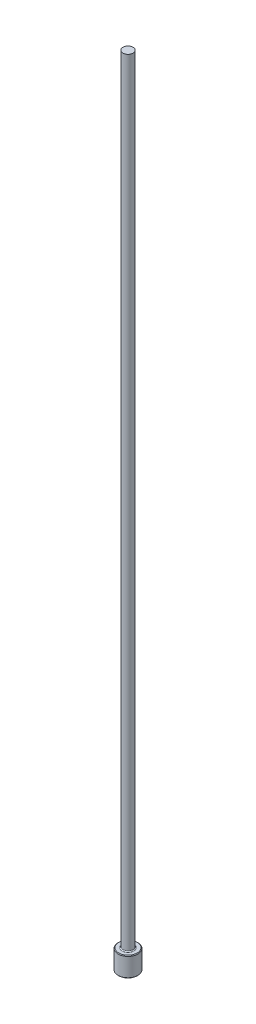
ISO-10303-21;
HEADER;
FILE_DESCRIPTION(('STEP AP214'),'2;1');
FILE_NAME('part.step','',(''),(''),'','','');
FILE_SCHEMA(('AUTOMOTIVE_DESIGN { 1 0 10303 214 1 1 1 1 }'));
ENDSEC;
DATA;
#1=APPLICATION_CONTEXT('core data for automotive mechanical design processes');
#2=APPLICATION_PROTOCOL_DEFINITION('international standard','automotive_design',2000,#1);
#3=PRODUCT_CONTEXT('',#1,'mechanical');
#4=PRODUCT('Part','Part','',(#3));
#5=PRODUCT_RELATED_PRODUCT_CATEGORY('part','',(#4));
#6=PRODUCT_DEFINITION_FORMATION('','',#4);
#7=PRODUCT_DEFINITION_CONTEXT('part definition',#1,'design');
#8=PRODUCT_DEFINITION('design','',#6,#7);
#9=PRODUCT_DEFINITION_SHAPE('','',#8);
#10=(LENGTH_UNIT() NAMED_UNIT(*) SI_UNIT(.MILLI.,.METRE.));
#11=(NAMED_UNIT(*) PLANE_ANGLE_UNIT() SI_UNIT($,.RADIAN.));
#12=(NAMED_UNIT(*) SI_UNIT($,.STERADIAN.) SOLID_ANGLE_UNIT());
#13=UNCERTAINTY_MEASURE_WITH_UNIT(LENGTH_MEASURE(1.E-05),#10,'distance_accuracy_value','');
#14=(GEOMETRIC_REPRESENTATION_CONTEXT(3) GLOBAL_UNCERTAINTY_ASSIGNED_CONTEXT((#13)) GLOBAL_UNIT_ASSIGNED_CONTEXT((#10,
#11,#12)) REPRESENTATION_CONTEXT('',''));
#15=CARTESIAN_POINT('',(0.,0.,0.));
#16=DIRECTION('',(0.,0.,1.));
#17=DIRECTION('',(1.,0.,0.));
#18=AXIS2_PLACEMENT_3D('',#15,#16,#17);
#19=CARTESIAN_POINT('',(0.,0.,0.));
#20=DIRECTION('',(0.,-1.,0.));
#21=DIRECTION('',(0.,0.,-1.));
#22=AXIS2_PLACEMENT_3D('',#19,#20,#21);
#23=PLANE('',#22);
#24=CARTESIAN_POINT('',(0.,0.,0.));
#25=DIRECTION('',(0.,-1.,0.));
#26=DIRECTION('',(0.,0.,-1.));
#27=AXIS2_PLACEMENT_3D('',#24,#25,#26);
#28=CIRCLE('',#27,0.736599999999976);
#29=CARTESIAN_POINT('',(0.,0.,0.736599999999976));
#30=VERTEX_POINT('',#29);
#31=EDGE_CURVE('E46',#30,#30,#28,.T.);
#32=ORIENTED_EDGE('',*,*,#31,.T.);
#33=EDGE_LOOP('',(#32));
#34=FACE_BOUND('',#33,.T.);
#35=ADVANCED_FACE('F35',(#34),#23,.T.);
#36=CARTESIAN_POINT('',(0.,259.958771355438,0.));
#37=DIRECTION('',(0.,1.,0.));
#38=DIRECTION('',(0.,0.,1.));
#39=AXIS2_PLACEMENT_3D('',#36,#37,#38);
#40=CYLINDRICAL_SURFACE('',#39,0.787399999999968);
#41=CARTESIAN_POINT('',(0.,1.52399999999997,0.));
#42=DIRECTION('',(0.,1.,0.));
#43=DIRECTION('',(0.,0.,1.));
#44=AXIS2_PLACEMENT_3D('',#41,#42,#43);
#45=CIRCLE('',#44,0.787399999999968);
#46=CARTESIAN_POINT('',(0.,1.52399999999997,0.787399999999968));
#47=VERTEX_POINT('',#46);
#48=EDGE_CURVE('E50',#47,#47,#45,.F.);
#49=ORIENTED_EDGE('',*,*,#48,.T.);
#50=EDGE_LOOP('',(#49));
#51=FACE_BOUND('',#50,.T.);
#52=CARTESIAN_POINT('',(0.,0.050799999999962,0.));
#53=DIRECTION('',(0.,-1.,0.));
#54=DIRECTION('',(0.,0.,-1.));
#55=AXIS2_PLACEMENT_3D('',#52,#53,#54);
#56=CIRCLE('',#55,0.787399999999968);
#57=CARTESIAN_POINT('',(0.,0.050799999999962,0.787399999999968));
#58=VERTEX_POINT('',#57);
#59=EDGE_CURVE('E55',#58,#58,#56,.F.);
#60=ORIENTED_EDGE('',*,*,#59,.T.);
#61=EDGE_LOOP('',(#60));
#62=FACE_BOUND('',#61,.T.);
#63=ADVANCED_FACE('F77',(#51,#62),#40,.T.);
#64=CARTESIAN_POINT('',(-0.787399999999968,1.5748,0.));
#65=DIRECTION('',(0.,1.,0.));
#66=DIRECTION('',(0.,0.,1.));
#67=AXIS2_PLACEMENT_3D('',#64,#65,#66);
#68=PLANE('',#67);
#69=CARTESIAN_POINT('',(0.,1.5748,0.));
#70=DIRECTION('',(0.,1.,0.));
#71=DIRECTION('',(0.,0.,1.));
#72=AXIS2_PLACEMENT_3D('',#69,#70,#71);
#73=CIRCLE('',#72,0.482599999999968);
#74=CARTESIAN_POINT('',(0.,1.5748,0.482599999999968));
#75=VERTEX_POINT('',#74);
#76=EDGE_CURVE('E10',#75,#75,#73,.F.);
#77=ORIENTED_EDGE('',*,*,#76,.T.);
#78=EDGE_LOOP('',(#77));
#79=FACE_BOUND('',#78,.T.);
#80=CARTESIAN_POINT('',(0.,1.5748,0.));
#81=DIRECTION('',(0.,1.,0.));
#82=DIRECTION('',(0.,0.,1.));
#83=AXIS2_PLACEMENT_3D('',#80,#81,#82);
#84=CIRCLE('',#83,0.73659999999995);
#85=CARTESIAN_POINT('',(0.,1.5748,0.73659999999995));
#86=VERTEX_POINT('',#85);
#87=EDGE_CURVE('E58',#86,#86,#84,.T.);
#88=ORIENTED_EDGE('',*,*,#87,.T.);
#89=EDGE_LOOP('',(#88));
#90=FACE_BOUND('',#89,.T.);
#91=ADVANCED_FACE('F69',(#79,#90),#68,.T.);
#92=CARTESIAN_POINT('',(0.,259.958771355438,0.));
#93=DIRECTION('',(0.,1.,0.));
#94=DIRECTION('',(0.,0.,1.));
#95=AXIS2_PLACEMENT_3D('',#92,#93,#94);
#96=CYLINDRICAL_SURFACE('',#95,0.406399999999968);
#97=CARTESIAN_POINT('',(0.,1.65100000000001,0.));
#98=DIRECTION('',(0.,1.,0.));
#99=DIRECTION('',(0.,0.,1.));
#100=AXIS2_PLACEMENT_3D('',#97,#98,#99);
#101=CIRCLE('',#100,0.406399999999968);
#102=CARTESIAN_POINT('',(0.,1.65100000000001,0.406399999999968));
#103=VERTEX_POINT('',#102);
#104=EDGE_CURVE('E42',#103,#103,#101,.T.);
#105=ORIENTED_EDGE('',*,*,#104,.T.);
#106=EDGE_LOOP('',(#105));
#107=FACE_BOUND('',#106,.T.);
#108=CARTESIAN_POINT('',(0.,63.5,0.));
#109=DIRECTION('',(0.,1.,0.));
#110=DIRECTION('',(0.,0.,1.));
#111=AXIS2_PLACEMENT_3D('',#108,#109,#110);
#112=CIRCLE('',#111,0.406399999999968);
#113=CARTESIAN_POINT('',(0.,63.5,0.406399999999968));
#114=VERTEX_POINT('',#113);
#115=EDGE_CURVE('E61',#114,#114,#112,.T.);
#116=ORIENTED_EDGE('',*,*,#115,.F.);
#117=EDGE_LOOP('',(#116));
#118=FACE_BOUND('',#117,.T.);
#119=ADVANCED_FACE('F67',(#107,#118),#96,.T.);
#120=CARTESIAN_POINT('',(-0.406399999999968,63.5,0.));
#121=DIRECTION('',(0.,1.,0.));
#122=DIRECTION('',(0.,0.,1.));
#123=AXIS2_PLACEMENT_3D('',#120,#121,#122);
#124=PLANE('',#123);
#125=ORIENTED_EDGE('',*,*,#115,.T.);
#126=EDGE_LOOP('',(#125));
#127=FACE_BOUND('',#126,.T.);
#128=ADVANCED_FACE('F65',(#127),#124,.T.);
#129=CARTESIAN_POINT('',(0.,1.57479999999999,0.));
#130=DIRECTION('',(0.,-1.,0.));
#131=DIRECTION('',(0.,0.,-1.));
#132=AXIS2_PLACEMENT_3D('',#129,#130,#131);
#133=CONICAL_SURFACE('',#132,0.736599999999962,0.785398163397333);
#134=ORIENTED_EDGE('',*,*,#48,.F.);
#135=EDGE_LOOP('',(#134));
#136=FACE_BOUND('',#135,.T.);
#137=ORIENTED_EDGE('',*,*,#87,.F.);
#138=EDGE_LOOP('',(#137));
#139=FACE_BOUND('',#138,.T.);
#140=ADVANCED_FACE('F75',(#136,#139),#133,.T.);
#141=CARTESIAN_POINT('',(0.,0.050799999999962,0.));
#142=DIRECTION('',(0.,1.,0.));
#143=DIRECTION('',(0.,0.,1.));
#144=AXIS2_PLACEMENT_3D('',#141,#142,#143);
#145=CONICAL_SURFACE('',#144,0.787399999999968,0.785398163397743);
#146=CARTESIAN_POINT('',(0.,0.,0.736599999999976));
#147=CARTESIAN_POINT('',(0.,0.000529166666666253,0.737129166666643));
#148=CARTESIAN_POINT('',(0.,0.00105833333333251,0.737658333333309));
#149=CARTESIAN_POINT('',(0.,0.00211666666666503,0.738716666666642));
#150=CARTESIAN_POINT('',(0.,0.00264583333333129,0.739245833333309));
#151=CARTESIAN_POINT('',(0.,0.00370416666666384,0.740304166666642));
#152=CARTESIAN_POINT('',(0.,0.00423333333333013,0.740833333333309));
#153=CARTESIAN_POINT('',(0.,0.00529166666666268,0.741891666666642));
#154=CARTESIAN_POINT('',(0.,0.00582083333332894,0.742420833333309));
#155=CARTESIAN_POINT('',(0.,0.00687916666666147,0.743479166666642));
#156=CARTESIAN_POINT('',(0.,0.00740833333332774,0.744008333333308));
#157=CARTESIAN_POINT('',(0.,0.00846666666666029,0.745066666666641));
#158=CARTESIAN_POINT('',(0.,0.00899583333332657,0.745595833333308));
#159=CARTESIAN_POINT('',(0.,0.0100541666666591,0.746654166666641));
#160=CARTESIAN_POINT('',(0.,0.0105833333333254,0.747183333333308));
#161=CARTESIAN_POINT('',(0.,0.0116416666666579,0.748241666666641));
#162=CARTESIAN_POINT('',(0.,0.0121708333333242,0.748770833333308));
#163=CARTESIAN_POINT('',(0.,0.0132291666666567,0.749829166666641));
#164=CARTESIAN_POINT('',(0.,0.013758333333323,0.750358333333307));
#165=CARTESIAN_POINT('',(0.,0.0148166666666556,0.75141666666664));
#166=CARTESIAN_POINT('',(0.,0.0153458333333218,0.751945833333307));
#167=CARTESIAN_POINT('',(0.,0.0164041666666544,0.75300416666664));
#168=CARTESIAN_POINT('',(0.,0.0169333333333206,0.753533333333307));
#169=CARTESIAN_POINT('',(0.,0.0179916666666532,0.75459166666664));
#170=CARTESIAN_POINT('',(0.,0.0185208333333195,0.755120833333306));
#171=CARTESIAN_POINT('',(0.,0.019579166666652,0.75617916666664));
#172=CARTESIAN_POINT('',(0.,0.0201083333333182,0.756708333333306));
#173=CARTESIAN_POINT('',(0.,0.0211666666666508,0.757766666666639));
#174=CARTESIAN_POINT('',(0.,0.0216958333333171,0.758295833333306));
#175=CARTESIAN_POINT('',(0.,0.0227541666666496,0.759354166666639));
#176=CARTESIAN_POINT('',(0.,0.0232833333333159,0.759883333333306));
#177=CARTESIAN_POINT('',(0.,0.0243416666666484,0.760941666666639));
#178=CARTESIAN_POINT('',(0.,0.0248708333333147,0.761470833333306));
#179=CARTESIAN_POINT('',(0.,0.0259291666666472,0.762529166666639));
#180=CARTESIAN_POINT('',(0.,0.0264583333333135,0.763058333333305));
#181=CARTESIAN_POINT('',(0.,0.0275166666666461,0.764116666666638));
#182=CARTESIAN_POINT('',(0.,0.0280458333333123,0.764645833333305));
#183=CARTESIAN_POINT('',(0.,0.0291041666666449,0.765704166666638));
#184=CARTESIAN_POINT('',(0.,0.0296333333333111,0.766233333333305));
#185=CARTESIAN_POINT('',(0.,0.0306916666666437,0.767291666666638));
#186=CARTESIAN_POINT('',(0.,0.03122083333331,0.767820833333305));
#187=CARTESIAN_POINT('',(0.,0.0322791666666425,0.768879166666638));
#188=CARTESIAN_POINT('',(0.,0.0328083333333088,0.769408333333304));
#189=CARTESIAN_POINT('',(0.,0.0338666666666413,0.770466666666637));
#190=CARTESIAN_POINT('',(0.,0.0343958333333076,0.770995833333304));
#191=CARTESIAN_POINT('',(0.,0.0354541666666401,0.772054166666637));
#192=CARTESIAN_POINT('',(0.,0.0359833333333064,0.772583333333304));
#193=CARTESIAN_POINT('',(0.,0.0370416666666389,0.773641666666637));
#194=CARTESIAN_POINT('',(0.,0.0375708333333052,0.774170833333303));
#195=CARTESIAN_POINT('',(0.,0.0386291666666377,0.775229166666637));
#196=CARTESIAN_POINT('',(0.,0.039158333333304,0.775758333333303));
#197=CARTESIAN_POINT('',(0.,0.0402166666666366,0.776816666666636));
#198=CARTESIAN_POINT('',(0.,0.0407458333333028,0.777345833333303));
#199=CARTESIAN_POINT('',(0.,0.0418041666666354,0.778404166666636));
#200=CARTESIAN_POINT('',(0.,0.0423333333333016,0.778933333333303));
#201=CARTESIAN_POINT('',(0.,0.0433916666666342,0.779991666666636));
#202=CARTESIAN_POINT('',(0.,0.0439208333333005,0.780520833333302));
#203=CARTESIAN_POINT('',(0.,0.044979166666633,0.781579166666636));
#204=CARTESIAN_POINT('',(0.,0.0455083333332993,0.782108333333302));
#205=CARTESIAN_POINT('',(0.,0.0465666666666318,0.783166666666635));
#206=CARTESIAN_POINT('',(0.,0.0470958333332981,0.783695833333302));
#207=CARTESIAN_POINT('',(0.,0.0481541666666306,0.784754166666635));
#208=CARTESIAN_POINT('',(0.,0.0486833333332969,0.785283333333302));
#209=CARTESIAN_POINT('',(0.,0.0497416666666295,0.786341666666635));
#210=CARTESIAN_POINT('',(0.,0.0502708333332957,0.786870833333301));
#211=CARTESIAN_POINT('',(0.,0.050799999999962,0.787399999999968));
#212=B_SPLINE_CURVE_WITH_KNOTS('',3,(#146,#147,#148,#149,#150,#151,#152,#153,#154,#155,#156,
#157,#158,#159,#160,#161,#162,#163,#164,#165,#166,#167,#168,#169,#170,#171,#172,#173,#174,#175,
#176,#177,#178,#179,#180,#181,#182,#183,#184,#185,#186,#187,#188,#189,#190,#191,#192,#193,#194,
#195,#196,#197,#198,#199,#200,#201,#202,#203,#204,#205,#206,#207,#208,#209,#210,#211),
.UNSPECIFIED.,.F.,.F.,(4,2,2,2,2,2,2,2,2,2,2,2,2,2,2,2,2,2,2,2,2,2,2,2,2,2,2,2,2,2,2,2,4),(0.,
0.00224506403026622,0.00449012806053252,0.00673519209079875,0.00898025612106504,
0.0112253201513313,0.0134703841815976,0.0157154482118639,0.0179605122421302,0.0202055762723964,
0.0224506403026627,0.024695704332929,0.0269407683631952,0.0291858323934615,0.0314308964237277,
0.033675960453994,0.0359210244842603,0.0381660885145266,0.0404111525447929,0.0426562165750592,
0.0449012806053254,0.0471463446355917,0.049391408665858,0.0516364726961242,0.0538815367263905,
0.0561266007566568,0.058371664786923,0.0606167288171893,0.0628617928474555,0.0651068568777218,
0.0673519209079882,0.0695969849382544,0.0718420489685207),.UNSPECIFIED.);
#213=EDGE_CURVE('BSEAM89',#30,#58,#212,.T.);
#214=ORIENTED_EDGE('',*,*,#31,.F.);
#215=ORIENTED_EDGE('',*,*,#59,.F.);
#216=ORIENTED_EDGE('',*,*,#213,.T.);
#217=ORIENTED_EDGE('',*,*,#213,.F.);
#218=EDGE_LOOP('',(#214,#216,#215,#217));
#219=FACE_BOUND('',#218,.T.);
#220=ADVANCED_FACE('F89',(#219),#145,.T.);
#221=CARTESIAN_POINT('',(0.,1.65100000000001,0.));
#222=DIRECTION('',(0.,1.,0.));
#223=DIRECTION('',(0.,0.,1.));
#224=AXIS2_PLACEMENT_3D('',#221,#222,#223);
#225=TOROIDAL_SURFACE('',#224,0.482599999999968,0.0762);
#226=ORIENTED_EDGE('',*,*,#76,.F.);
#227=EDGE_LOOP('',(#226));
#228=FACE_BOUND('',#227,.T.);
#229=ORIENTED_EDGE('',*,*,#104,.F.);
#230=EDGE_LOOP('',(#229));
#231=FACE_BOUND('',#230,.T.);
#232=ADVANCED_FACE('F37',(#228,#231),#225,.F.);
#233=CLOSED_SHELL('',(#35,#63,#91,#119,#128,#140,#220,#232));
#234=MANIFOLD_SOLID_BREP('B2',#233);
#235=ADVANCED_BREP_SHAPE_REPRESENTATION('',(#18,#234),#14);
#236=SHAPE_DEFINITION_REPRESENTATION(#9,#235);
ENDSEC;
END-ISO-10303-21;
